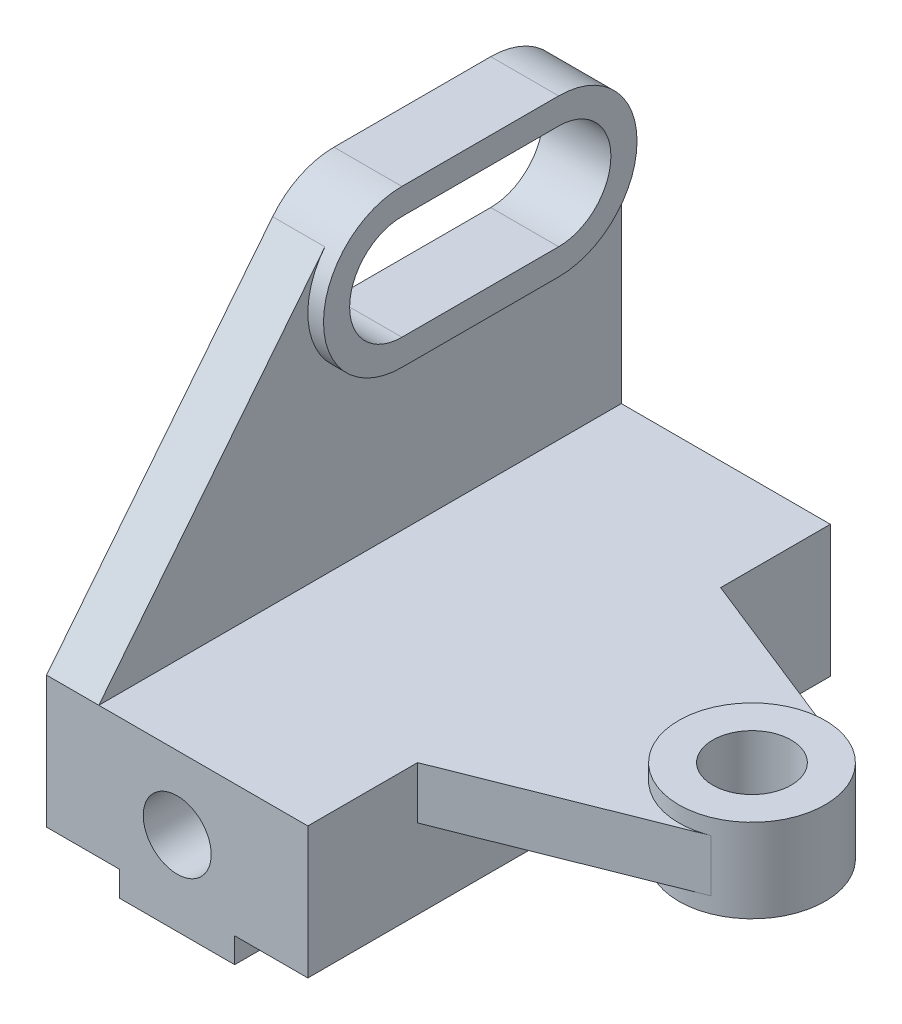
ISO-10303-21;
HEADER;
FILE_DESCRIPTION(('STEP AP214'),'2;1');
FILE_NAME('part.step','',(''),(''),'','','');
FILE_SCHEMA(('AUTOMOTIVE_DESIGN { 1 0 10303 214 1 1 1 1 }'));
ENDSEC;
DATA;
#1=APPLICATION_CONTEXT('core data for automotive mechanical design processes');
#2=APPLICATION_PROTOCOL_DEFINITION('international standard','automotive_design',2000,#1);
#3=PRODUCT_CONTEXT('',#1,'mechanical');
#4=PRODUCT('Part','Part','',(#3));
#5=PRODUCT_RELATED_PRODUCT_CATEGORY('part','',(#4));
#6=PRODUCT_DEFINITION_FORMATION('','',#4);
#7=PRODUCT_DEFINITION_CONTEXT('part definition',#1,'design');
#8=PRODUCT_DEFINITION('design','',#6,#7);
#9=PRODUCT_DEFINITION_SHAPE('','',#8);
#10=(LENGTH_UNIT() NAMED_UNIT(*) SI_UNIT(.MILLI.,.METRE.));
#11=(NAMED_UNIT(*) PLANE_ANGLE_UNIT() SI_UNIT($,.RADIAN.));
#12=(NAMED_UNIT(*) SI_UNIT($,.STERADIAN.) SOLID_ANGLE_UNIT());
#13=UNCERTAINTY_MEASURE_WITH_UNIT(LENGTH_MEASURE(1.E-05),#10,'distance_accuracy_value','');
#14=(GEOMETRIC_REPRESENTATION_CONTEXT(3) GLOBAL_UNCERTAINTY_ASSIGNED_CONTEXT((#13)) GLOBAL_UNIT_ASSIGNED_CONTEXT((#10,
#11,#12)) REPRESENTATION_CONTEXT('',''));
#15=CARTESIAN_POINT('',(0.,0.,0.));
#16=DIRECTION('',(0.,0.,1.));
#17=DIRECTION('',(1.,0.,0.));
#18=AXIS2_PLACEMENT_3D('',#15,#16,#17);
#19=CARTESIAN_POINT('',(0.,25.2,0.));
#20=DIRECTION('',(0.,1.,0.));
#21=DIRECTION('',(0.,0.,1.));
#22=AXIS2_PLACEMENT_3D('',#19,#20,#21);
#23=PLANE('',#22);
#24=DIRECTION('',(1.,0.,0.));
#25=VECTOR('',#24,1.);
#26=CARTESIAN_POINT('',(0.,25.2,-100.));
#27=LINE('',#26,#25);
#28=CARTESIAN_POINT('',(10.,25.2,-100.));
#29=VERTEX_POINT('',#28);
#30=CARTESIAN_POINT('',(50.,25.2,-100.));
#31=VERTEX_POINT('',#30);
#32=EDGE_CURVE('E363',#29,#31,#27,.T.);
#33=ORIENTED_EDGE('',*,*,#32,.F.);
#34=DIRECTION('',(0.,0.,-1.));
#35=VECTOR('',#34,1.);
#36=CARTESIAN_POINT('',(10.,25.2,0.));
#37=LINE('',#36,#35);
#38=CARTESIAN_POINT('',(10.,25.2,0.));
#39=VERTEX_POINT('',#38);
#40=EDGE_CURVE('E251',#39,#29,#37,.T.);
#41=ORIENTED_EDGE('',*,*,#40,.F.);
#42=DIRECTION('',(1.,0.,0.));
#43=VECTOR('',#42,1.);
#44=CARTESIAN_POINT('',(0.,25.2,0.));
#45=LINE('',#44,#43);
#46=CARTESIAN_POINT('',(50.,25.2,0.));
#47=VERTEX_POINT('',#46);
#48=EDGE_CURVE('E362',#39,#47,#45,.T.);
#49=ORIENTED_EDGE('',*,*,#48,.T.);
#50=DIRECTION('',(0.,0.,-1.));
#51=VECTOR('',#50,1.);
#52=CARTESIAN_POINT('',(50.,25.2,0.));
#53=LINE('',#52,#51);
#54=CARTESIAN_POINT('',(50.,25.2,-21.));
#55=VERTEX_POINT('',#54);
#56=EDGE_CURVE('E356',#47,#55,#53,.T.);
#57=ORIENTED_EDGE('',*,*,#56,.T.);
#58=DIRECTION('',(0.92910086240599,0.,-0.369826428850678));
#59=VECTOR('',#58,1.);
#60=CARTESIAN_POINT('',(-0.37714775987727,25.2,-0.947493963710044));
#61=LINE('',#60,#59);
#62=CARTESIAN_POINT('',(90.1775700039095,25.2,-36.9925879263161));
#63=VERTEX_POINT('',#62);
#64=EDGE_CURVE('E62',#55,#63,#61,.T.);
#65=ORIENTED_EDGE('',*,*,#64,.T.);
#66=CARTESIAN_POINT('',(85.,25.2,-50.));
#67=DIRECTION('',(0.,1.,0.));
#68=DIRECTION('',(0.,0.,1.));
#69=AXIS2_PLACEMENT_3D('',#66,#67,#68);
#70=CIRCLE('',#69,14.);
#71=CARTESIAN_POINT('',(90.1775700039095,25.2,-63.0074120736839));
#72=VERTEX_POINT('',#71);
#73=EDGE_CURVE('E330',#72,#63,#70,.T.);
#74=ORIENTED_EDGE('',*,*,#73,.F.);
#75=DIRECTION('',(-0.92910086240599,0.,-0.369826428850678));
#76=VECTOR('',#75,1.);
#77=CARTESIAN_POINT('',(33.9834576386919,25.2,-85.3753472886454));
#78=LINE('',#77,#76);
#79=CARTESIAN_POINT('',(50.,25.2,-79.));
#80=VERTEX_POINT('',#79);
#81=EDGE_CURVE('E300',#72,#80,#78,.T.);
#82=ORIENTED_EDGE('',*,*,#81,.T.);
#83=EDGE_CURVE('E364',#80,#31,#53,.T.);
#84=ORIENTED_EDGE('',*,*,#83,.T.);
#85=EDGE_LOOP('',(#33,#41,#49,#57,#65,#74,#82,#84));
#86=FACE_BOUND('',#85,.T.);
#87=ADVANCED_FACE('F38',(#86),#23,.T.);
#88=CARTESIAN_POINT('',(50.,25.2,0.));
#89=DIRECTION('',(-1.,0.,0.));
#90=DIRECTION('',(0.,0.,1.));
#91=AXIS2_PLACEMENT_3D('',#88,#89,#90);
#92=PLANE('',#91);
#93=DIRECTION('',(0.,1.,0.));
#94=VECTOR('',#93,1.);
#95=CARTESIAN_POINT('',(50.,15.2,-79.));
#96=LINE('',#95,#94);
#97=CARTESIAN_POINT('',(50.,15.2,-79.));
#98=VERTEX_POINT('',#97);
#99=EDGE_CURVE('E315',#98,#80,#96,.T.);
#100=ORIENTED_EDGE('',*,*,#99,.F.);
#101=DIRECTION('',(0.,0.,-1.));
#102=VECTOR('',#101,1.);
#103=CARTESIAN_POINT('',(50.,15.2,0.));
#104=LINE('',#103,#102);
#105=CARTESIAN_POINT('',(50.,15.2,-21.));
#106=VERTEX_POINT('',#105);
#107=EDGE_CURVE('E303',#106,#98,#104,.T.);
#108=ORIENTED_EDGE('',*,*,#107,.F.);
#109=DIRECTION('',(0.,1.,0.));
#110=VECTOR('',#109,1.);
#111=CARTESIAN_POINT('',(50.,15.2,-21.));
#112=LINE('',#111,#110);
#113=EDGE_CURVE('E311',#106,#55,#112,.T.);
#114=ORIENTED_EDGE('',*,*,#113,.T.);
#115=ORIENTED_EDGE('',*,*,#56,.F.);
#116=DIRECTION('',(0.,-1.,0.));
#117=VECTOR('',#116,1.);
#118=CARTESIAN_POINT('',(50.,25.2,0.));
#119=LINE('',#118,#117);
#120=CARTESIAN_POINT('',(50.,0.,0.));
#121=VERTEX_POINT('',#120);
#122=EDGE_CURVE('E333',#47,#121,#119,.T.);
#123=ORIENTED_EDGE('',*,*,#122,.T.);
#124=DIRECTION('',(0.,0.,-1.));
#125=VECTOR('',#124,1.);
#126=CARTESIAN_POINT('',(50.,0.,0.));
#127=LINE('',#126,#125);
#128=CARTESIAN_POINT('',(50.,0.,-100.));
#129=VERTEX_POINT('',#128);
#130=EDGE_CURVE('E382',#121,#129,#127,.T.);
#131=ORIENTED_EDGE('',*,*,#130,.T.);
#132=DIRECTION('',(0.,-1.,0.));
#133=VECTOR('',#132,1.);
#134=CARTESIAN_POINT('',(50.,25.2,-100.));
#135=LINE('',#134,#133);
#136=EDGE_CURVE('E393',#31,#129,#135,.T.);
#137=ORIENTED_EDGE('',*,*,#136,.F.);
#138=ORIENTED_EDGE('',*,*,#83,.F.);
#139=EDGE_LOOP('',(#100,#108,#114,#115,#123,#131,#137,#138));
#140=FACE_BOUND('',#139,.T.);
#141=ADVANCED_FACE('F354',(#140),#92,.F.);
#142=CARTESIAN_POINT('',(0.,0.,0.));
#143=DIRECTION('',(0.,1.,0.));
#144=DIRECTION('',(0.,0.,1.));
#145=AXIS2_PLACEMENT_3D('',#142,#143,#144);
#146=PLANE('',#145);
#147=DIRECTION('',(1.,0.,0.));
#148=VECTOR('',#147,1.);
#149=CARTESIAN_POINT('',(0.,0.,0.));
#150=LINE('',#149,#148);
#151=CARTESIAN_POINT('',(36.,0.,0.));
#152=VERTEX_POINT('',#151);
#153=EDGE_CURVE('E386',#152,#121,#150,.T.);
#154=ORIENTED_EDGE('',*,*,#153,.F.);
#155=DIRECTION('',(0.,0.,-1.));
#156=VECTOR('',#155,1.);
#157=CARTESIAN_POINT('',(36.,0.,0.));
#158=LINE('',#157,#156);
#159=CARTESIAN_POINT('',(36.,0.,-100.));
#160=VERTEX_POINT('',#159);
#161=EDGE_CURVE('E314',#152,#160,#158,.T.);
#162=ORIENTED_EDGE('',*,*,#161,.T.);
#163=DIRECTION('',(1.,0.,0.));
#164=VECTOR('',#163,1.);
#165=CARTESIAN_POINT('',(0.,0.,-100.));
#166=LINE('',#165,#164);
#167=EDGE_CURVE('E405',#160,#129,#166,.T.);
#168=ORIENTED_EDGE('',*,*,#167,.T.);
#169=ORIENTED_EDGE('',*,*,#130,.F.);
#170=EDGE_LOOP('',(#154,#162,#168,#169));
#171=FACE_BOUND('',#170,.T.);
#172=ADVANCED_FACE('F419',(#171),#146,.F.);
#173=CARTESIAN_POINT('',(0.,25.2,0.));
#174=DIRECTION('',(0.,0.,-1.));
#175=DIRECTION('',(-1.,0.,0.));
#176=AXIS2_PLACEMENT_3D('',#173,#174,#175);
#177=PLANE('',#176);
#178=CARTESIAN_POINT('',(25.,11.2,0.));
#179=DIRECTION('',(0.,0.,1.));
#180=DIRECTION('',(1.,0.,0.));
#181=AXIS2_PLACEMENT_3D('',#178,#179,#180);
#182=CIRCLE('',#181,6.5);
#183=CARTESIAN_POINT('',(31.5,11.2,0.));
#184=VERTEX_POINT('',#183);
#185=EDGE_CURVE('E499',#184,#184,#182,.T.);
#186=ORIENTED_EDGE('',*,*,#185,.F.);
#187=EDGE_LOOP('',(#186));
#188=FACE_BOUND('',#187,.T.);
#189=CARTESIAN_POINT('',(0.,0.,0.));
#190=VERTEX_POINT('',#189);
#191=CARTESIAN_POINT('',(14.,0.,0.));
#192=VERTEX_POINT('',#191);
#193=EDGE_CURVE('E389',#190,#192,#150,.T.);
#194=ORIENTED_EDGE('',*,*,#193,.T.);
#195=DIRECTION('',(0.,1.,0.));
#196=VECTOR('',#195,1.);
#197=CARTESIAN_POINT('',(14.,-4.8,0.));
#198=LINE('',#197,#196);
#199=CARTESIAN_POINT('',(14.,-4.8,0.));
#200=VERTEX_POINT('',#199);
#201=EDGE_CURVE('E422',#200,#192,#198,.T.);
#202=ORIENTED_EDGE('',*,*,#201,.F.);
#203=DIRECTION('',(1.,0.,0.));
#204=VECTOR('',#203,1.);
#205=CARTESIAN_POINT('',(0.,-4.8,0.));
#206=LINE('',#205,#204);
#207=CARTESIAN_POINT('',(36.,-4.8,0.));
#208=VERTEX_POINT('',#207);
#209=EDGE_CURVE('E308',#200,#208,#206,.T.);
#210=ORIENTED_EDGE('',*,*,#209,.T.);
#211=DIRECTION('',(0.,1.,0.));
#212=VECTOR('',#211,1.);
#213=CARTESIAN_POINT('',(36.,-4.8,0.));
#214=LINE('',#213,#212);
#215=EDGE_CURVE('E437',#208,#152,#214,.T.);
#216=ORIENTED_EDGE('',*,*,#215,.T.);
#217=ORIENTED_EDGE('',*,*,#153,.T.);
#218=ORIENTED_EDGE('',*,*,#122,.F.);
#219=ORIENTED_EDGE('',*,*,#48,.F.);
#220=CARTESIAN_POINT('',(0.,25.2,0.));
#221=VERTEX_POINT('',#220);
#222=EDGE_CURVE('E369',#221,#39,#45,.T.);
#223=ORIENTED_EDGE('',*,*,#222,.F.);
#224=DIRECTION('',(0.,-1.,0.));
#225=VECTOR('',#224,1.);
#226=CARTESIAN_POINT('',(0.,25.2,0.));
#227=LINE('',#226,#225);
#228=EDGE_CURVE('E366',#221,#190,#227,.T.);
#229=ORIENTED_EDGE('',*,*,#228,.T.);
#230=EDGE_LOOP('',(#194,#202,#210,#216,#217,#218,#219,#223,#229));
#231=FACE_BOUND('',#230,.T.);
#232=ADVANCED_FACE('F40',(#188,#231),#177,.F.);
#233=CARTESIAN_POINT('',(0.,25.2,-100.));
#234=DIRECTION('',(0.,0.,-1.));
#235=DIRECTION('',(-1.,0.,0.));
#236=AXIS2_PLACEMENT_3D('',#233,#234,#235);
#237=PLANE('',#236);
#238=CARTESIAN_POINT('',(25.,11.2,-100.));
#239=DIRECTION('',(0.,0.,-1.));
#240=DIRECTION('',(-1.,0.,0.));
#241=AXIS2_PLACEMENT_3D('',#238,#239,#240);
#242=CIRCLE('',#241,6.5);
#243=CARTESIAN_POINT('',(18.5,11.2,-100.));
#244=VERTEX_POINT('',#243);
#245=EDGE_CURVE('E42',#244,#244,#242,.T.);
#246=ORIENTED_EDGE('',*,*,#245,.F.);
#247=EDGE_LOOP('',(#246));
#248=FACE_BOUND('',#247,.T.);
#249=CARTESIAN_POINT('',(0.,0.,-100.));
#250=VERTEX_POINT('',#249);
#251=CARTESIAN_POINT('',(14.,0.,-100.));
#252=VERTEX_POINT('',#251);
#253=EDGE_CURVE('E401',#250,#252,#166,.T.);
#254=ORIENTED_EDGE('',*,*,#253,.F.);
#255=DIRECTION('',(0.,-1.,0.));
#256=VECTOR('',#255,1.);
#257=CARTESIAN_POINT('',(0.,25.2,-100.));
#258=LINE('',#257,#256);
#259=CARTESIAN_POINT('',(0.,70.2,-100.));
#260=VERTEX_POINT('',#259);
#261=EDGE_CURVE('E396',#260,#250,#258,.T.);
#262=ORIENTED_EDGE('',*,*,#261,.F.);
#263=DIRECTION('',(-1.,0.,0.));
#264=VECTOR('',#263,1.);
#265=CARTESIAN_POINT('',(10.,70.2,-100.));
#266=LINE('',#265,#264);
#267=CARTESIAN_POINT('',(10.,70.2,-100.));
#268=VERTEX_POINT('',#267);
#269=EDGE_CURVE('E203',#268,#260,#266,.T.);
#270=ORIENTED_EDGE('',*,*,#269,.F.);
#271=DIRECTION('',(0.,1.,0.));
#272=VECTOR('',#271,1.);
#273=CARTESIAN_POINT('',(10.,0.,-100.));
#274=LINE('',#273,#272);
#275=EDGE_CURVE('E247',#29,#268,#274,.T.);
#276=ORIENTED_EDGE('',*,*,#275,.F.);
#277=ORIENTED_EDGE('',*,*,#32,.T.);
#278=ORIENTED_EDGE('',*,*,#136,.T.);
#279=ORIENTED_EDGE('',*,*,#167,.F.);
#280=DIRECTION('',(0.,1.,0.));
#281=VECTOR('',#280,1.);
#282=CARTESIAN_POINT('',(36.,-4.8,-100.));
#283=LINE('',#282,#281);
#284=CARTESIAN_POINT('',(36.,-4.8,-100.));
#285=VERTEX_POINT('',#284);
#286=EDGE_CURVE('E428',#285,#160,#283,.T.);
#287=ORIENTED_EDGE('',*,*,#286,.F.);
#288=DIRECTION('',(1.,0.,0.));
#289=VECTOR('',#288,1.);
#290=CARTESIAN_POINT('',(0.,-4.8,-100.));
#291=LINE('',#290,#289);
#292=CARTESIAN_POINT('',(14.,-4.8,-100.));
#293=VERTEX_POINT('',#292);
#294=EDGE_CURVE('E446',#293,#285,#291,.T.);
#295=ORIENTED_EDGE('',*,*,#294,.F.);
#296=DIRECTION('',(0.,1.,0.));
#297=VECTOR('',#296,1.);
#298=CARTESIAN_POINT('',(14.,-4.8,-100.));
#299=LINE('',#298,#297);
#300=EDGE_CURVE('E423',#293,#252,#299,.T.);
#301=ORIENTED_EDGE('',*,*,#300,.T.);
#302=EDGE_LOOP('',(#254,#262,#270,#276,#277,#278,#279,#287,#295,#301));
#303=FACE_BOUND('',#302,.T.);
#304=ADVANCED_FACE('F464',(#248,#303),#237,.T.);
#305=CARTESIAN_POINT('',(0.,25.2,0.));
#306=DIRECTION('',(-1.,0.,0.));
#307=DIRECTION('',(0.,0.,1.));
#308=AXIS2_PLACEMENT_3D('',#305,#306,#307);
#309=PLANE('',#308);
#310=DIRECTION('',(0.,0.,-1.));
#311=VECTOR('',#310,1.);
#312=CARTESIAN_POINT('',(0.,0.,0.));
#313=LINE('',#312,#311);
#314=EDGE_CURVE('E399',#190,#250,#313,.T.);
#315=ORIENTED_EDGE('',*,*,#314,.F.);
#316=ORIENTED_EDGE('',*,*,#228,.F.);
#317=DIRECTION('',(0.,0.782336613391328,-0.622855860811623));
#318=VECTOR('',#317,1.);
#319=CARTESIAN_POINT('',(0.,9.77632546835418,12.2795302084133));
#320=LINE('',#319,#318);
#321=CARTESIAN_POINT('',(0.,79.5428379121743,-43.2649507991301));
#322=VERTEX_POINT('',#321);
#323=EDGE_CURVE('E242',#221,#322,#320,.T.);
#324=ORIENTED_EDGE('',*,*,#323,.T.);
#325=CARTESIAN_POINT('',(0.,70.2,-55.));
#326=DIRECTION('',(-1.,0.,0.));
#327=DIRECTION('',(0.,0.,1.));
#328=AXIS2_PLACEMENT_3D('',#325,#326,#327);
#329=CIRCLE('',#328,15.);
#330=CARTESIAN_POINT('',(0.,85.2,-55.));
#331=VERTEX_POINT('',#330);
#332=EDGE_CURVE('E256',#322,#331,#329,.T.);
#333=ORIENTED_EDGE('',*,*,#332,.T.);
#334=DIRECTION('',(0.,0.,-1.));
#335=VECTOR('',#334,1.);
#336=CARTESIAN_POINT('',(0.,85.2,0.));
#337=LINE('',#336,#335);
#338=CARTESIAN_POINT('',(0.,85.2,-85.));
#339=VERTEX_POINT('',#338);
#340=EDGE_CURVE('E259',#331,#339,#337,.T.);
#341=ORIENTED_EDGE('',*,*,#340,.T.);
#342=CARTESIAN_POINT('',(0.,70.2,-85.));
#343=DIRECTION('',(-1.,0.,0.));
#344=DIRECTION('',(0.,0.,1.));
#345=AXIS2_PLACEMENT_3D('',#342,#343,#344);
#346=CIRCLE('',#345,15.);
#347=EDGE_CURVE('E262',#339,#260,#346,.T.);
#348=ORIENTED_EDGE('',*,*,#347,.T.);
#349=ORIENTED_EDGE('',*,*,#261,.T.);
#350=EDGE_LOOP('',(#315,#316,#324,#333,#341,#348,#349));
#351=FACE_BOUND('',#350,.T.);
#352=CARTESIAN_POINT('',(0.,70.2,-55.));
#353=DIRECTION('',(-1.,0.,0.));
#354=DIRECTION('',(0.,0.,1.));
#355=AXIS2_PLACEMENT_3D('',#352,#353,#354);
#356=CIRCLE('',#355,10.);
#357=CARTESIAN_POINT('',(0.,60.2,-55.));
#358=VERTEX_POINT('',#357);
#359=CARTESIAN_POINT('',(0.,80.2,-55.));
#360=VERTEX_POINT('',#359);
#361=EDGE_CURVE('E265',#358,#360,#356,.T.);
#362=ORIENTED_EDGE('',*,*,#361,.F.);
#363=DIRECTION('',(0.,0.,-1.));
#364=VECTOR('',#363,1.);
#365=CARTESIAN_POINT('',(0.,60.2,0.));
#366=LINE('',#365,#364);
#367=CARTESIAN_POINT('',(0.,60.2,-85.));
#368=VERTEX_POINT('',#367);
#369=EDGE_CURVE('E198',#358,#368,#366,.T.);
#370=ORIENTED_EDGE('',*,*,#369,.T.);
#371=CARTESIAN_POINT('',(0.,70.2,-85.));
#372=DIRECTION('',(-1.,0.,0.));
#373=DIRECTION('',(0.,0.,1.));
#374=AXIS2_PLACEMENT_3D('',#371,#372,#373);
#375=CIRCLE('',#374,10.);
#376=CARTESIAN_POINT('',(0.,80.2,-85.));
#377=VERTEX_POINT('',#376);
#378=EDGE_CURVE('E268',#377,#368,#375,.T.);
#379=ORIENTED_EDGE('',*,*,#378,.F.);
#380=DIRECTION('',(0.,0.,-1.));
#381=VECTOR('',#380,1.);
#382=CARTESIAN_POINT('',(0.,80.2,0.));
#383=LINE('',#382,#381);
#384=EDGE_CURVE('E248',#360,#377,#383,.T.);
#385=ORIENTED_EDGE('',*,*,#384,.F.);
#386=EDGE_LOOP('',(#362,#370,#379,#385));
#387=FACE_BOUND('',#386,.T.);
#388=ADVANCED_FACE('F459',(#351,#387),#309,.T.);
#389=ORIENTED_EDGE('',*,*,#253,.T.);
#390=DIRECTION('',(0.,0.,1.));
#391=VECTOR('',#390,1.);
#392=CARTESIAN_POINT('',(14.,0.,0.));
#393=LINE('',#392,#391);
#394=EDGE_CURVE('E431',#252,#192,#393,.T.);
#395=ORIENTED_EDGE('',*,*,#394,.T.);
#396=ORIENTED_EDGE('',*,*,#193,.F.);
#397=ORIENTED_EDGE('',*,*,#314,.T.);
#398=EDGE_LOOP('',(#389,#395,#396,#397));
#399=FACE_BOUND('',#398,.T.);
#400=ADVANCED_FACE('F454',(#399),#146,.F.);
#401=CARTESIAN_POINT('',(14.,-4.8,0.));
#402=DIRECTION('',(-1.,0.,0.));
#403=DIRECTION('',(0.,0.,1.));
#404=AXIS2_PLACEMENT_3D('',#401,#402,#403);
#405=PLANE('',#404);
#406=ORIENTED_EDGE('',*,*,#394,.F.);
#407=ORIENTED_EDGE('',*,*,#300,.F.);
#408=DIRECTION('',(0.,0.,1.));
#409=VECTOR('',#408,1.);
#410=CARTESIAN_POINT('',(14.,-4.8,0.));
#411=LINE('',#410,#409);
#412=EDGE_CURVE('E443',#293,#200,#411,.T.);
#413=ORIENTED_EDGE('',*,*,#412,.T.);
#414=ORIENTED_EDGE('',*,*,#201,.T.);
#415=EDGE_LOOP('',(#406,#407,#413,#414));
#416=FACE_BOUND('',#415,.T.);
#417=ADVANCED_FACE('F468',(#416),#405,.T.);
#418=CARTESIAN_POINT('',(36.,-4.8,0.));
#419=DIRECTION('',(1.,0.,0.));
#420=DIRECTION('',(0.,0.,-1.));
#421=AXIS2_PLACEMENT_3D('',#418,#419,#420);
#422=PLANE('',#421);
#423=ORIENTED_EDGE('',*,*,#161,.F.);
#424=ORIENTED_EDGE('',*,*,#215,.F.);
#425=DIRECTION('',(0.,0.,-1.));
#426=VECTOR('',#425,1.);
#427=CARTESIAN_POINT('',(36.,-4.8,0.));
#428=LINE('',#427,#426);
#429=EDGE_CURVE('E447',#208,#285,#428,.T.);
#430=ORIENTED_EDGE('',*,*,#429,.T.);
#431=ORIENTED_EDGE('',*,*,#286,.T.);
#432=EDGE_LOOP('',(#423,#424,#430,#431));
#433=FACE_BOUND('',#432,.T.);
#434=ADVANCED_FACE('F471',(#433),#422,.T.);
#435=CARTESIAN_POINT('',(0.,-4.8,0.));
#436=DIRECTION('',(0.,1.,0.));
#437=DIRECTION('',(0.,0.,1.));
#438=AXIS2_PLACEMENT_3D('',#435,#436,#437);
#439=PLANE('',#438);
#440=ORIENTED_EDGE('',*,*,#209,.F.);
#441=ORIENTED_EDGE('',*,*,#412,.F.);
#442=ORIENTED_EDGE('',*,*,#294,.T.);
#443=ORIENTED_EDGE('',*,*,#429,.F.);
#444=EDGE_LOOP('',(#440,#441,#442,#443));
#445=FACE_BOUND('',#444,.T.);
#446=ADVANCED_FACE('F470',(#445),#439,.F.);
#447=CARTESIAN_POINT('',(-0.37714775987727,15.2,-0.947493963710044));
#448=DIRECTION('',(0.369826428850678,0.,0.92910086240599));
#449=DIRECTION('',(0.92910086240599,0.,-0.369826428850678));
#450=AXIS2_PLACEMENT_3D('',#447,#448,#449);
#451=PLANE('',#450);
#452=ORIENTED_EDGE('',*,*,#64,.F.);
#453=ORIENTED_EDGE('',*,*,#113,.F.);
#454=DIRECTION('',(0.92910086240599,0.,-0.369826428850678));
#455=VECTOR('',#454,1.);
#456=CARTESIAN_POINT('',(-0.37714775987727,15.2,-0.947493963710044));
#457=LINE('',#456,#455);
#458=CARTESIAN_POINT('',(90.1775700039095,15.2,-36.9925879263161));
#459=VERTEX_POINT('',#458);
#460=EDGE_CURVE('E296',#106,#459,#457,.T.);
#461=ORIENTED_EDGE('',*,*,#460,.T.);
#462=DIRECTION('',(0.,1.,0.));
#463=VECTOR('',#462,1.);
#464=CARTESIAN_POINT('',(90.1775700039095,15.2,-36.9925879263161));
#465=LINE('',#464,#463);
#466=EDGE_CURVE('E305',#459,#63,#465,.T.);
#467=ORIENTED_EDGE('',*,*,#466,.T.);
#468=EDGE_LOOP('',(#452,#453,#461,#467));
#469=FACE_BOUND('',#468,.T.);
#470=ADVANCED_FACE('F349',(#469),#451,.T.);
#471=CARTESIAN_POINT('',(33.9834576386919,15.2,-85.3753472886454));
#472=DIRECTION('',(0.369826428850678,0.,-0.92910086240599));
#473=DIRECTION('',(-0.92910086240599,0.,-0.369826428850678));
#474=AXIS2_PLACEMENT_3D('',#471,#472,#473);
#475=PLANE('',#474);
#476=ORIENTED_EDGE('',*,*,#81,.F.);
#477=DIRECTION('',(0.,1.,0.));
#478=VECTOR('',#477,1.);
#479=CARTESIAN_POINT('',(90.1775700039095,15.2,-63.0074120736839));
#480=LINE('',#479,#478);
#481=CARTESIAN_POINT('',(90.1775700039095,15.2,-63.0074120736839));
#482=VERTEX_POINT('',#481);
#483=EDGE_CURVE('E319',#482,#72,#480,.T.);
#484=ORIENTED_EDGE('',*,*,#483,.F.);
#485=DIRECTION('',(-0.92910086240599,0.,-0.369826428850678));
#486=VECTOR('',#485,1.);
#487=CARTESIAN_POINT('',(33.9834576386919,15.2,-85.3753472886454));
#488=LINE('',#487,#486);
#489=EDGE_CURVE('E299',#482,#98,#488,.T.);
#490=ORIENTED_EDGE('',*,*,#489,.T.);
#491=ORIENTED_EDGE('',*,*,#99,.T.);
#492=EDGE_LOOP('',(#476,#484,#490,#491));
#493=FACE_BOUND('',#492,.T.);
#494=ADVANCED_FACE('F560',(#493),#475,.T.);
#495=CARTESIAN_POINT('',(85.,15.2,-50.));
#496=DIRECTION('',(0.,1.,0.));
#497=DIRECTION('',(0.,0.,1.));
#498=AXIS2_PLACEMENT_3D('',#495,#496,#497);
#499=CYLINDRICAL_SURFACE('',#498,14.);
#500=ORIENTED_EDGE('',*,*,#483,.T.);
#501=ORIENTED_EDGE('',*,*,#73,.T.);
#502=ORIENTED_EDGE('',*,*,#466,.F.);
#503=CARTESIAN_POINT('',(85.,15.2,-50.));
#504=DIRECTION('',(0.,1.,0.));
#505=DIRECTION('',(0.,0.,1.));
#506=AXIS2_PLACEMENT_3D('',#503,#504,#505);
#507=CIRCLE('',#506,14.);
#508=EDGE_CURVE('E47',#482,#459,#507,.T.);
#509=ORIENTED_EDGE('',*,*,#508,.F.);
#510=EDGE_LOOP('',(#500,#501,#502,#509));
#511=FACE_BOUND('',#510,.T.);
#512=CARTESIAN_POINT('',(85.,28.2,-50.));
#513=DIRECTION('',(0.,1.,0.));
#514=DIRECTION('',(0.,0.,1.));
#515=AXIS2_PLACEMENT_3D('',#512,#513,#514);
#516=CIRCLE('',#515,14.);
#517=CARTESIAN_POINT('',(85.,28.2,-36.));
#518=VERTEX_POINT('',#517);
#519=EDGE_CURVE('E293',#518,#518,#516,.T.);
#520=ORIENTED_EDGE('',*,*,#519,.F.);
#521=EDGE_LOOP('',(#520));
#522=FACE_BOUND('',#521,.T.);
#523=CARTESIAN_POINT('',(85.,12.2,-50.));
#524=DIRECTION('',(0.,1.,0.));
#525=DIRECTION('',(0.,0.,1.));
#526=AXIS2_PLACEMENT_3D('',#523,#524,#525);
#527=CIRCLE('',#526,14.);
#528=CARTESIAN_POINT('',(85.,12.2,-36.));
#529=VERTEX_POINT('',#528);
#530=EDGE_CURVE('E287',#529,#529,#527,.T.);
#531=ORIENTED_EDGE('',*,*,#530,.T.);
#532=EDGE_LOOP('',(#531));
#533=FACE_BOUND('',#532,.T.);
#534=ADVANCED_FACE('F347',(#511,#522,#533),#499,.T.);
#535=CARTESIAN_POINT('',(85.,15.2,-50.));
#536=DIRECTION('',(0.,1.,0.));
#537=DIRECTION('',(0.,0.,1.));
#538=AXIS2_PLACEMENT_3D('',#535,#536,#537);
#539=CYLINDRICAL_SURFACE('',#538,7.5);
#540=CARTESIAN_POINT('',(85.,28.2,-50.));
#541=DIRECTION('',(0.,1.,0.));
#542=DIRECTION('',(0.,0.,1.));
#543=AXIS2_PLACEMENT_3D('',#540,#541,#542);
#544=CIRCLE('',#543,7.5);
#545=CARTESIAN_POINT('',(85.,28.2,-42.5));
#546=VERTEX_POINT('',#545);
#547=EDGE_CURVE('E290',#546,#546,#544,.T.);
#548=ORIENTED_EDGE('',*,*,#547,.T.);
#549=EDGE_LOOP('',(#548));
#550=FACE_BOUND('',#549,.T.);
#551=CARTESIAN_POINT('',(85.,12.2,-50.));
#552=DIRECTION('',(0.,1.,0.));
#553=DIRECTION('',(0.,0.,1.));
#554=AXIS2_PLACEMENT_3D('',#551,#552,#553);
#555=CIRCLE('',#554,7.5);
#556=CARTESIAN_POINT('',(85.,12.2,-42.5));
#557=VERTEX_POINT('',#556);
#558=EDGE_CURVE('E273',#557,#557,#555,.T.);
#559=ORIENTED_EDGE('',*,*,#558,.F.);
#560=EDGE_LOOP('',(#559));
#561=FACE_BOUND('',#560,.T.);
#562=ADVANCED_FACE('F556',(#550,#561),#539,.F.);
#563=CARTESIAN_POINT('',(0.,15.2,0.));
#564=DIRECTION('',(0.,1.,0.));
#565=DIRECTION('',(0.,0.,1.));
#566=AXIS2_PLACEMENT_3D('',#563,#564,#565);
#567=PLANE('',#566);
#568=ORIENTED_EDGE('',*,*,#489,.F.);
#569=ORIENTED_EDGE('',*,*,#508,.T.);
#570=ORIENTED_EDGE('',*,*,#460,.F.);
#571=ORIENTED_EDGE('',*,*,#107,.T.);
#572=EDGE_LOOP('',(#568,#569,#570,#571));
#573=FACE_BOUND('',#572,.T.);
#574=ADVANCED_FACE('F343',(#573),#567,.F.);
#575=CARTESIAN_POINT('',(0.,28.2,0.));
#576=DIRECTION('',(0.,1.,0.));
#577=DIRECTION('',(0.,0.,1.));
#578=AXIS2_PLACEMENT_3D('',#575,#576,#577);
#579=PLANE('',#578);
#580=ORIENTED_EDGE('',*,*,#547,.F.);
#581=EDGE_LOOP('',(#580));
#582=FACE_BOUND('',#581,.T.);
#583=ORIENTED_EDGE('',*,*,#519,.T.);
#584=EDGE_LOOP('',(#583));
#585=FACE_BOUND('',#584,.T.);
#586=ADVANCED_FACE('F549',(#582,#585),#579,.T.);
#587=CARTESIAN_POINT('',(0.,12.2,0.));
#588=DIRECTION('',(0.,1.,0.));
#589=DIRECTION('',(0.,0.,1.));
#590=AXIS2_PLACEMENT_3D('',#587,#588,#589);
#591=PLANE('',#590);
#592=ORIENTED_EDGE('',*,*,#558,.T.);
#593=EDGE_LOOP('',(#592));
#594=FACE_BOUND('',#593,.T.);
#595=ORIENTED_EDGE('',*,*,#530,.F.);
#596=EDGE_LOOP('',(#595));
#597=FACE_BOUND('',#596,.T.);
#598=ADVANCED_FACE('F532',(#594,#597),#591,.F.);
#599=CARTESIAN_POINT('',(10.,70.2,-55.));
#600=DIRECTION('',(-1.,0.,0.));
#601=DIRECTION('',(0.,0.,1.));
#602=AXIS2_PLACEMENT_3D('',#599,#600,#601);
#603=CYLINDRICAL_SURFACE('',#602,10.);
#604=ORIENTED_EDGE('',*,*,#361,.T.);
#605=DIRECTION('',(-1.,0.,0.));
#606=VECTOR('',#605,1.);
#607=CARTESIAN_POINT('',(10.,80.2,-55.));
#608=LINE('',#607,#606);
#609=CARTESIAN_POINT('',(13.,80.2,-55.));
#610=VERTEX_POINT('',#609);
#611=EDGE_CURVE('E209',#610,#360,#608,.T.);
#612=ORIENTED_EDGE('',*,*,#611,.F.);
#613=CARTESIAN_POINT('',(13.,70.2,-55.));
#614=DIRECTION('',(-1.,0.,0.));
#615=DIRECTION('',(0.,0.,1.));
#616=AXIS2_PLACEMENT_3D('',#613,#614,#615);
#617=CIRCLE('',#616,10.);
#618=CARTESIAN_POINT('',(13.,60.2,-55.));
#619=VERTEX_POINT('',#618);
#620=EDGE_CURVE('E206',#619,#610,#617,.T.);
#621=ORIENTED_EDGE('',*,*,#620,.F.);
#622=DIRECTION('',(-1.,0.,0.));
#623=VECTOR('',#622,1.);
#624=CARTESIAN_POINT('',(10.,60.2,-55.));
#625=LINE('',#624,#623);
#626=EDGE_CURVE('E192',#619,#358,#625,.T.);
#627=ORIENTED_EDGE('',*,*,#626,.T.);
#628=EDGE_LOOP('',(#604,#612,#621,#627));
#629=FACE_BOUND('',#628,.T.);
#630=ADVANCED_FACE('F207',(#629),#603,.F.);
#631=CARTESIAN_POINT('',(10.,80.2,0.));
#632=DIRECTION('',(0.,1.,0.));
#633=DIRECTION('',(0.,0.,1.));
#634=AXIS2_PLACEMENT_3D('',#631,#632,#633);
#635=PLANE('',#634);
#636=ORIENTED_EDGE('',*,*,#384,.T.);
#637=DIRECTION('',(-1.,0.,0.));
#638=VECTOR('',#637,1.);
#639=CARTESIAN_POINT('',(10.,80.2,-85.));
#640=LINE('',#639,#638);
#641=CARTESIAN_POINT('',(13.,80.2,-85.));
#642=VERTEX_POINT('',#641);
#643=EDGE_CURVE('E274',#642,#377,#640,.T.);
#644=ORIENTED_EDGE('',*,*,#643,.F.);
#645=DIRECTION('',(0.,0.,-1.));
#646=VECTOR('',#645,1.);
#647=CARTESIAN_POINT('',(13.,80.2,0.));
#648=LINE('',#647,#646);
#649=EDGE_CURVE('E221',#610,#642,#648,.T.);
#650=ORIENTED_EDGE('',*,*,#649,.F.);
#651=ORIENTED_EDGE('',*,*,#611,.T.);
#652=EDGE_LOOP('',(#636,#644,#650,#651));
#653=FACE_BOUND('',#652,.T.);
#654=ADVANCED_FACE('F518',(#653),#635,.F.);
#655=CARTESIAN_POINT('',(10.,70.2,-85.));
#656=DIRECTION('',(-1.,0.,0.));
#657=DIRECTION('',(0.,0.,1.));
#658=AXIS2_PLACEMENT_3D('',#655,#656,#657);
#659=CYLINDRICAL_SURFACE('',#658,10.);
#660=ORIENTED_EDGE('',*,*,#378,.T.);
#661=DIRECTION('',(-1.,0.,0.));
#662=VECTOR('',#661,1.);
#663=CARTESIAN_POINT('',(10.,60.2,-85.));
#664=LINE('',#663,#662);
#665=CARTESIAN_POINT('',(13.,60.2,-85.));
#666=VERTEX_POINT('',#665);
#667=EDGE_CURVE('E202',#666,#368,#664,.T.);
#668=ORIENTED_EDGE('',*,*,#667,.F.);
#669=CARTESIAN_POINT('',(13.,70.2,-85.));
#670=DIRECTION('',(-1.,0.,0.));
#671=DIRECTION('',(0.,0.,1.));
#672=AXIS2_PLACEMENT_3D('',#669,#670,#671);
#673=CIRCLE('',#672,10.);
#674=EDGE_CURVE('E219',#642,#666,#673,.T.);
#675=ORIENTED_EDGE('',*,*,#674,.F.);
#676=ORIENTED_EDGE('',*,*,#643,.T.);
#677=EDGE_LOOP('',(#660,#668,#675,#676));
#678=FACE_BOUND('',#677,.T.);
#679=ADVANCED_FACE('F521',(#678),#659,.F.);
#680=CARTESIAN_POINT('',(10.,9.77632546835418,12.2795302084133));
#681=DIRECTION('',(0.,0.622855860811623,0.782336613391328));
#682=DIRECTION('',(0.,-0.782336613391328,0.622855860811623));
#683=AXIS2_PLACEMENT_3D('',#680,#681,#682);
#684=PLANE('',#683);
#685=ORIENTED_EDGE('',*,*,#323,.F.);
#686=ORIENTED_EDGE('',*,*,#222,.T.);
#687=DIRECTION('',(0.,0.782336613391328,-0.622855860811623));
#688=VECTOR('',#687,1.);
#689=CARTESIAN_POINT('',(10.,9.77632546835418,12.2795302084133));
#690=LINE('',#689,#688);
#691=CARTESIAN_POINT('',(10.,79.5428379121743,-43.2649507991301));
#692=VERTEX_POINT('',#691);
#693=EDGE_CURVE('E244',#39,#692,#690,.T.);
#694=ORIENTED_EDGE('',*,*,#693,.T.);
#695=DIRECTION('',(-1.,0.,0.));
#696=VECTOR('',#695,1.);
#697=CARTESIAN_POINT('',(10.,79.5428379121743,-43.2649507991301));
#698=LINE('',#697,#696);
#699=EDGE_CURVE('E253',#692,#322,#698,.T.);
#700=ORIENTED_EDGE('',*,*,#699,.T.);
#701=EDGE_LOOP('',(#685,#686,#694,#700));
#702=FACE_BOUND('',#701,.T.);
#703=ADVANCED_FACE('F525',(#702),#684,.T.);
#704=CARTESIAN_POINT('',(10.,70.2,-85.));
#705=DIRECTION('',(-1.,0.,0.));
#706=DIRECTION('',(0.,0.,1.));
#707=AXIS2_PLACEMENT_3D('',#704,#705,#706);
#708=CYLINDRICAL_SURFACE('',#707,15.);
#709=ORIENTED_EDGE('',*,*,#347,.F.);
#710=DIRECTION('',(-1.,0.,0.));
#711=VECTOR('',#710,1.);
#712=CARTESIAN_POINT('',(10.,85.2,-85.));
#713=LINE('',#712,#711);
#714=CARTESIAN_POINT('',(13.,85.2,-85.));
#715=VERTEX_POINT('',#714);
#716=EDGE_CURVE('E280',#715,#339,#713,.T.);
#717=ORIENTED_EDGE('',*,*,#716,.F.);
#718=CARTESIAN_POINT('',(13.,70.2,-85.));
#719=DIRECTION('',(-1.,0.,0.));
#720=DIRECTION('',(0.,0.,1.));
#721=AXIS2_PLACEMENT_3D('',#718,#719,#720);
#722=CIRCLE('',#721,15.);
#723=CARTESIAN_POINT('',(13.,55.2,-85.));
#724=VERTEX_POINT('',#723);
#725=EDGE_CURVE('E229',#715,#724,#722,.T.);
#726=ORIENTED_EDGE('',*,*,#725,.T.);
#727=DIRECTION('',(-1.,0.,0.));
#728=VECTOR('',#727,1.);
#729=CARTESIAN_POINT('',(13.,55.2,-85.));
#730=LINE('',#729,#728);
#731=CARTESIAN_POINT('',(10.,55.2,-85.));
#732=VERTEX_POINT('',#731);
#733=EDGE_CURVE('E237',#724,#732,#730,.T.);
#734=ORIENTED_EDGE('',*,*,#733,.T.);
#735=CARTESIAN_POINT('',(10.,70.2,-85.));
#736=DIRECTION('',(-1.,0.,0.));
#737=DIRECTION('',(0.,0.,1.));
#738=AXIS2_PLACEMENT_3D('',#735,#736,#737);
#739=CIRCLE('',#738,15.);
#740=EDGE_CURVE('E11',#268,#732,#739,.T.);
#741=ORIENTED_EDGE('',*,*,#740,.F.);
#742=ORIENTED_EDGE('',*,*,#269,.T.);
#743=EDGE_LOOP('',(#709,#717,#726,#734,#741,#742));
#744=FACE_BOUND('',#743,.T.);
#745=ADVANCED_FACE('F533',(#744),#708,.T.);
#746=CARTESIAN_POINT('',(10.,85.2,0.));
#747=DIRECTION('',(0.,1.,0.));
#748=DIRECTION('',(0.,0.,1.));
#749=AXIS2_PLACEMENT_3D('',#746,#747,#748);
#750=PLANE('',#749);
#751=ORIENTED_EDGE('',*,*,#340,.F.);
#752=DIRECTION('',(-1.,0.,0.));
#753=VECTOR('',#752,1.);
#754=CARTESIAN_POINT('',(10.,85.2,-55.));
#755=LINE('',#754,#753);
#756=CARTESIAN_POINT('',(13.,85.2,-55.));
#757=VERTEX_POINT('',#756);
#758=EDGE_CURVE('E282',#757,#331,#755,.T.);
#759=ORIENTED_EDGE('',*,*,#758,.F.);
#760=DIRECTION('',(0.,0.,-1.));
#761=VECTOR('',#760,1.);
#762=CARTESIAN_POINT('',(13.,85.2,0.));
#763=LINE('',#762,#761);
#764=EDGE_CURVE('E226',#757,#715,#763,.T.);
#765=ORIENTED_EDGE('',*,*,#764,.T.);
#766=ORIENTED_EDGE('',*,*,#716,.T.);
#767=EDGE_LOOP('',(#751,#759,#765,#766));
#768=FACE_BOUND('',#767,.T.);
#769=ADVANCED_FACE('F536',(#768),#750,.T.);
#770=CARTESIAN_POINT('',(10.,70.2,-55.));
#771=DIRECTION('',(-1.,0.,0.));
#772=DIRECTION('',(0.,0.,1.));
#773=AXIS2_PLACEMENT_3D('',#770,#771,#772);
#774=CYLINDRICAL_SURFACE('',#773,15.);
#775=ORIENTED_EDGE('',*,*,#332,.F.);
#776=ORIENTED_EDGE('',*,*,#699,.F.);
#777=CARTESIAN_POINT('',(10.,70.2,-55.));
#778=DIRECTION('',(-1.,0.,0.));
#779=DIRECTION('',(0.,0.,1.));
#780=AXIS2_PLACEMENT_3D('',#777,#778,#779);
#781=CIRCLE('',#780,15.);
#782=CARTESIAN_POINT('',(10.,55.2,-55.));
#783=VERTEX_POINT('',#782);
#784=EDGE_CURVE('E213',#783,#692,#781,.T.);
#785=ORIENTED_EDGE('',*,*,#784,.F.);
#786=DIRECTION('',(-1.,0.,0.));
#787=VECTOR('',#786,1.);
#788=CARTESIAN_POINT('',(13.,55.2,-55.));
#789=LINE('',#788,#787);
#790=CARTESIAN_POINT('',(13.,55.2,-55.));
#791=VERTEX_POINT('',#790);
#792=EDGE_CURVE('E240',#791,#783,#789,.T.);
#793=ORIENTED_EDGE('',*,*,#792,.F.);
#794=CARTESIAN_POINT('',(13.,70.2,-55.));
#795=DIRECTION('',(-1.,0.,0.));
#796=DIRECTION('',(0.,0.,1.));
#797=AXIS2_PLACEMENT_3D('',#794,#795,#796);
#798=CIRCLE('',#797,15.);
#799=EDGE_CURVE('E234',#791,#757,#798,.T.);
#800=ORIENTED_EDGE('',*,*,#799,.T.);
#801=ORIENTED_EDGE('',*,*,#758,.T.);
#802=EDGE_LOOP('',(#775,#776,#785,#793,#800,#801));
#803=FACE_BOUND('',#802,.T.);
#804=ADVANCED_FACE('F529',(#803),#774,.T.);
#805=CARTESIAN_POINT('',(10.,60.2,0.));
#806=DIRECTION('',(0.,1.,0.));
#807=DIRECTION('',(0.,0.,1.));
#808=AXIS2_PLACEMENT_3D('',#805,#806,#807);
#809=PLANE('',#808);
#810=ORIENTED_EDGE('',*,*,#369,.F.);
#811=ORIENTED_EDGE('',*,*,#626,.F.);
#812=DIRECTION('',(0.,0.,-1.));
#813=VECTOR('',#812,1.);
#814=CARTESIAN_POINT('',(13.,60.2,0.));
#815=LINE('',#814,#813);
#816=EDGE_CURVE('E196',#619,#666,#815,.T.);
#817=ORIENTED_EDGE('',*,*,#816,.T.);
#818=ORIENTED_EDGE('',*,*,#667,.T.);
#819=EDGE_LOOP('',(#810,#811,#817,#818));
#820=FACE_BOUND('',#819,.T.);
#821=ADVANCED_FACE('F194',(#820),#809,.T.);
#822=CARTESIAN_POINT('',(10.,0.,0.));
#823=DIRECTION('',(-1.,0.,0.));
#824=DIRECTION('',(0.,0.,1.));
#825=AXIS2_PLACEMENT_3D('',#822,#823,#824);
#826=PLANE('',#825);
#827=DIRECTION('',(0.,0.,-1.));
#828=VECTOR('',#827,1.);
#829=CARTESIAN_POINT('',(10.,55.2,0.));
#830=LINE('',#829,#828);
#831=EDGE_CURVE('E54',#783,#732,#830,.T.);
#832=ORIENTED_EDGE('',*,*,#831,.F.);
#833=ORIENTED_EDGE('',*,*,#784,.T.);
#834=ORIENTED_EDGE('',*,*,#693,.F.);
#835=ORIENTED_EDGE('',*,*,#40,.T.);
#836=ORIENTED_EDGE('',*,*,#275,.T.);
#837=ORIENTED_EDGE('',*,*,#740,.T.);
#838=EDGE_LOOP('',(#832,#833,#834,#835,#836,#837));
#839=FACE_BOUND('',#838,.T.);
#840=ADVANCED_FACE('F514',(#839),#826,.F.);
#841=CARTESIAN_POINT('',(13.,55.2,0.));
#842=DIRECTION('',(0.,1.,0.));
#843=DIRECTION('',(0.,0.,1.));
#844=AXIS2_PLACEMENT_3D('',#841,#842,#843);
#845=PLANE('',#844);
#846=ORIENTED_EDGE('',*,*,#831,.T.);
#847=ORIENTED_EDGE('',*,*,#733,.F.);
#848=DIRECTION('',(0.,0.,-1.));
#849=VECTOR('',#848,1.);
#850=CARTESIAN_POINT('',(13.,55.2,0.));
#851=LINE('',#850,#849);
#852=EDGE_CURVE('E232',#791,#724,#851,.T.);
#853=ORIENTED_EDGE('',*,*,#852,.F.);
#854=ORIENTED_EDGE('',*,*,#792,.T.);
#855=EDGE_LOOP('',(#846,#847,#853,#854));
#856=FACE_BOUND('',#855,.T.);
#857=ADVANCED_FACE('F509',(#856),#845,.F.);
#858=CARTESIAN_POINT('',(13.,0.,0.));
#859=DIRECTION('',(-1.,0.,0.));
#860=DIRECTION('',(0.,0.,1.));
#861=AXIS2_PLACEMENT_3D('',#858,#859,#860);
#862=PLANE('',#861);
#863=ORIENTED_EDGE('',*,*,#620,.T.);
#864=ORIENTED_EDGE('',*,*,#649,.T.);
#865=ORIENTED_EDGE('',*,*,#674,.T.);
#866=ORIENTED_EDGE('',*,*,#816,.F.);
#867=EDGE_LOOP('',(#863,#864,#865,#866));
#868=FACE_BOUND('',#867,.T.);
#869=ORIENTED_EDGE('',*,*,#764,.F.);
#870=ORIENTED_EDGE('',*,*,#799,.F.);
#871=ORIENTED_EDGE('',*,*,#852,.T.);
#872=ORIENTED_EDGE('',*,*,#725,.F.);
#873=EDGE_LOOP('',(#869,#870,#871,#872));
#874=FACE_BOUND('',#873,.T.);
#875=ADVANCED_FACE('F216',(#868,#874),#862,.F.);
#876=CARTESIAN_POINT('',(25.,11.2,-100.00005));
#877=DIRECTION('',(0.,0.,1.));
#878=DIRECTION('',(1.,0.,0.));
#879=AXIS2_PLACEMENT_3D('',#876,#877,#878);
#880=CYLINDRICAL_SURFACE('',#879,6.5);
#881=ORIENTED_EDGE('',*,*,#245,.T.);
#882=EDGE_LOOP('',(#881));
#883=FACE_BOUND('',#882,.T.);
#884=ORIENTED_EDGE('',*,*,#185,.T.);
#885=EDGE_LOOP('',(#884));
#886=FACE_BOUND('',#885,.T.);
#887=ADVANCED_FACE('F503',(#883,#886),#880,.F.);
#888=CLOSED_SHELL('',(#87,#141,#172,#232,#304,#388,#400,#417,#434,#446,#470,#494,#534,#562,#574,
#586,#598,#630,#654,#679,#703,#745,#769,#804,#821,#840,#857,#875,#887));
#889=MANIFOLD_SOLID_BREP('B2',#888);
#890=ADVANCED_BREP_SHAPE_REPRESENTATION('',(#18,#889),#14);
#891=SHAPE_DEFINITION_REPRESENTATION(#9,#890);
ENDSEC;
END-ISO-10303-21;
